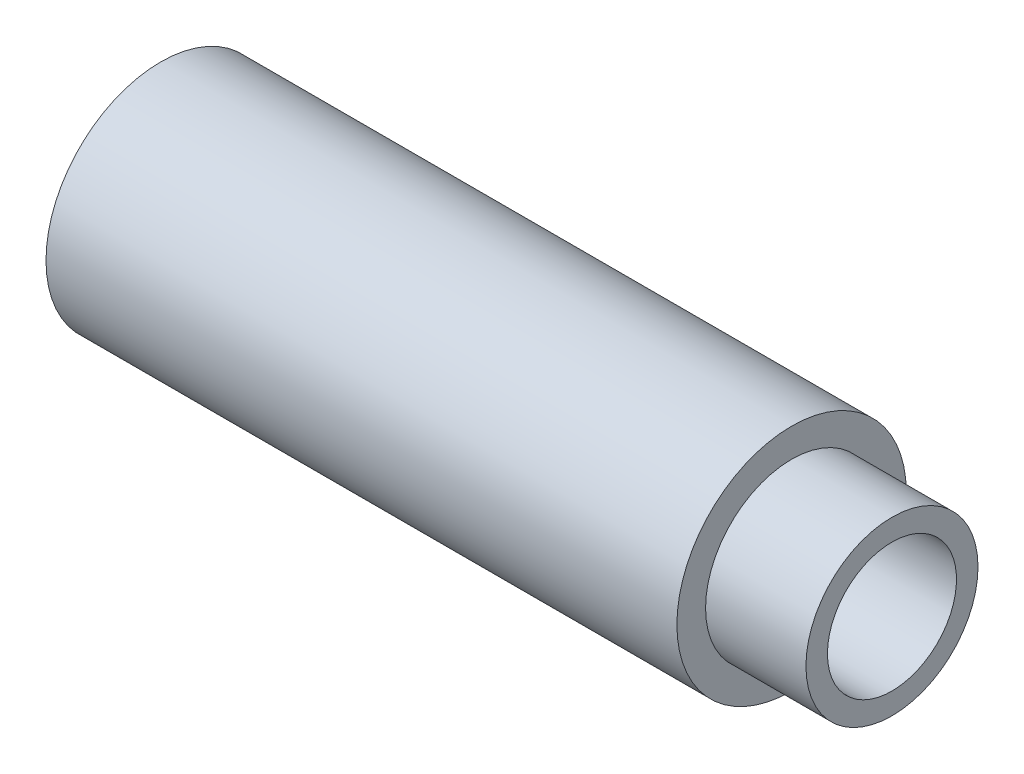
from build123d import *


with BuildPart() as part:
    # Sketch1 → Revolve1 (revolve)
    with BuildSketch(Plane.XY, mode=Mode.PRIVATE) as revolve1_sk:
        Polygon((0, 2.25), (25.5, 2.25), (25.5, 3), (22, 3), (22, 4), (0, 4), align=None)
    revolve(revolve1_sk.sketch.rotate(Axis((0, 0, 0), (1, 0, 0)), 90), axis=Axis((0, 0, 0), (1, 0, 0)))


solid = part.part
